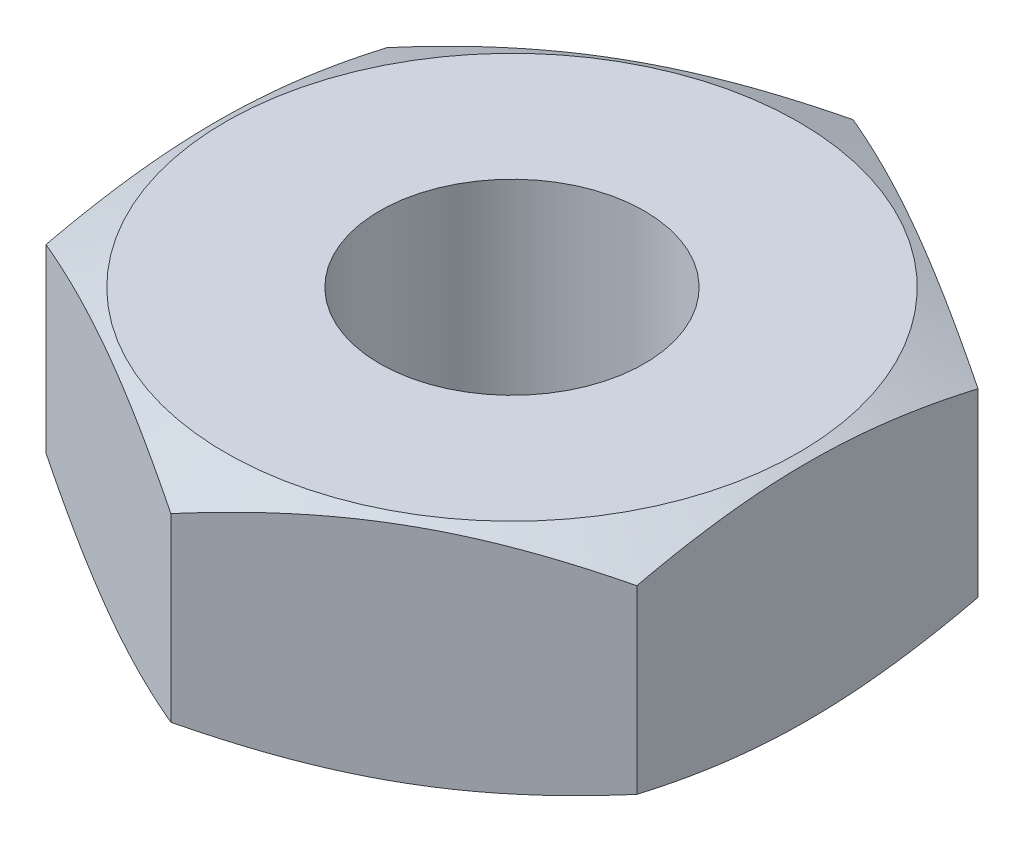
from build123d import *

# Parameters (mm, degrees)
SKETCH2_W          = 8.06558326
SKETCH2_H          = 8.06558326
CUT_EXTRUDE1_DEPTH = 2.4892


with BuildPart() as part:
    # Sketch1 → Base-Revolve (revolve)
    with BuildSketch(Plane.XY, mode=Mode.PRIVATE) as base_revolve_sk:
        Polygon((1.4224, 0), (1.4224, 2.4892), (3.079586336, 2.4892), (3.666174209, 2.215669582), (3.666174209, 0.273530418), (3.079586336, 0), align=None)
    revolve(base_revolve_sk.sketch.rotate(Axis((0, -24.892, 0), (0, 1, 0)), 90), axis=Axis((0, -24.892, 0), (0, 1, 0)))

    # Sketch2 → Cut-Extrude1 (cut)
    with BuildSketch(Plane(origin=(0, 0, 0), x_dir=(1, 0, 0), z_dir=(0, 1, 0))):
        Rectangle(SKETCH2_W, SKETCH2_H)
        Polygon((3.175, 1.833087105), (0, 3.666174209), (-3.175, 1.833087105), (-3.175, -1.833087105), (0, -3.666174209), (3.175, -1.833087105), align=None, mode=Mode.SUBTRACT)
    extrude(amount=CUT_EXTRUDE1_DEPTH, mode=Mode.SUBTRACT)


solid = part.part
